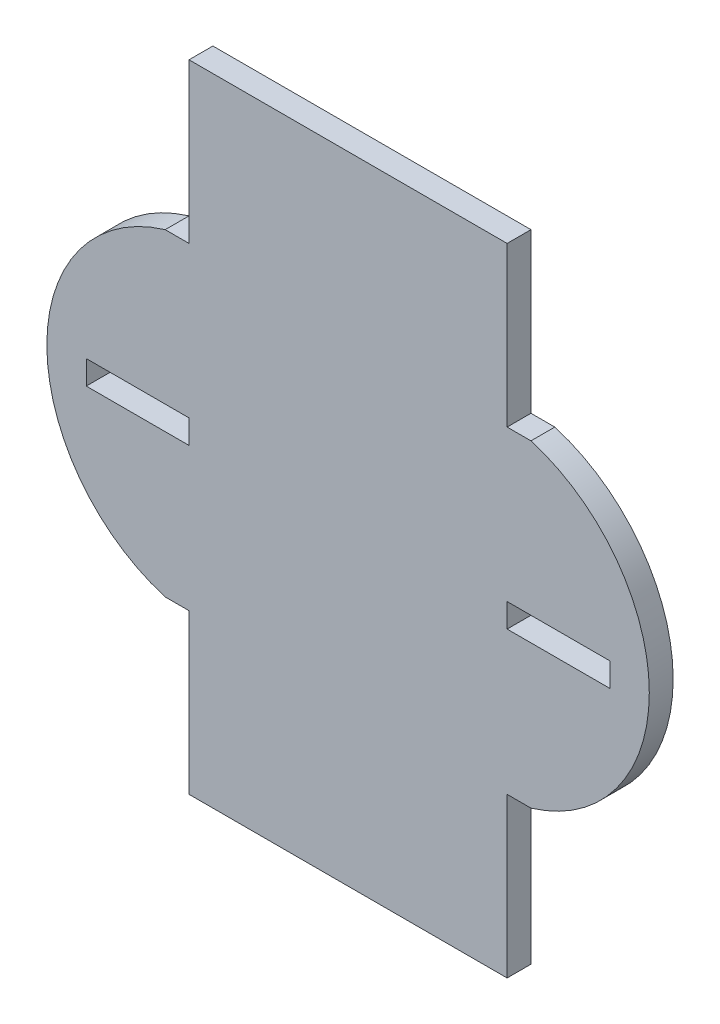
from build123d import *

# Parameters (mm, degrees)
ESQUISSE1_W        = 12.923892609
ESQUISSE1_H        = 3
ESQUISSE1_W_2      = 12.92389261
BOSS_EXTRU_1_DEPTH = 3


with BuildPart() as part:
    # Esquisse1 → Boss.-Extru.1 (new body)
    with BuildSketch(Plane.XY):
        with BuildLine():
            Line((-21.315764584, 46.815642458), (-24.315764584, 46.815642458))
            ThreePointArc((-24.315764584, 46.815642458), (-39.196377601, 26.815642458), (-24.315764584, 6.815642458))
            Line((-24.315764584, 6.815642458), (-21.315764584, 6.815642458))
            Line((-21.315764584, 6.815642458), (-21.315764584, -13.184357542))
            Line((-21.315764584, -13.184357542), (18.684235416, -13.184357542))
            Line((18.684235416, -13.184357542), (18.684235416, 6.815642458))
            Line((18.684235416, 6.815642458), (21.684235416, 6.815642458))
            ThreePointArc((21.684235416, 6.815642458), (36.564848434, 26.815642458), (21.684235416, 46.815642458))
            Line((21.684235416, 46.815642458), (18.684235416, 46.815642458))
            Line((18.684235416, 46.815642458), (18.684235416, 66.815642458))
            Line((18.684235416, 66.815642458), (-21.315764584, 66.815642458))
            Line((-21.315764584, 66.815642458), (-21.315764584, 46.815642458))
        make_face()
        with Locations((-27.777710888, 26.315642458)):
            Rectangle(ESQUISSE1_W, ESQUISSE1_H, mode=Mode.SUBTRACT)
        with Locations((25.146181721, 26.315642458)):
            Rectangle(ESQUISSE1_W_2, ESQUISSE1_H, mode=Mode.SUBTRACT)
    extrude(amount=BOSS_EXTRU_1_DEPTH)


solid = part.part
